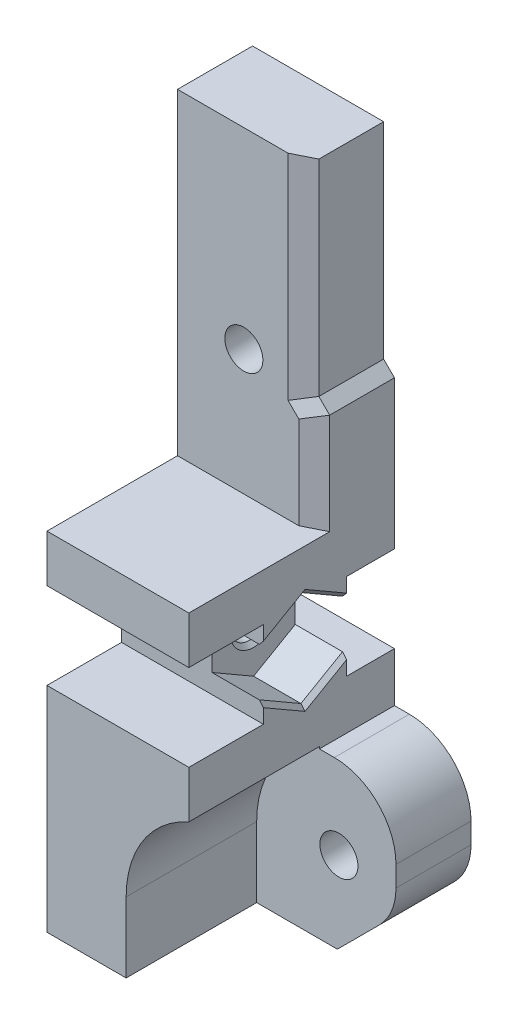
from build123d import *

# Parameters (mm, degrees)
SKETCH1_W           = 13.8
SKETCH1_H           = 17.6
BOSS_EXTRUDE1_DEPTH = 20
BOSS_EXTRUDE2_DEPTH = 7.3
BOSS_EXTRUDE3_DEPTH = 7.3
BOSS_EXTRUDE4_DEPTH = 12.7
CUT_EXTRUDE1_DEPTH  = 55.42350444
SKETCH7_R           = 1.85
CUT_EXTRUDE2_DEPTH  = 55.42350444
SKETCH8_R           = 1.85
CUT_EXTRUDE3_DEPTH  = 55.42350444
CUT_EXTRUDE4_DEPTH  = 4
SKETCH10_W          = 4.65
SKETCH10_H          = 8.4
CUT_EXTRUDE5_DEPTH  = 57.574091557
CUT_EXTRUDE7_DEPTH  = 5
SKETCH15_R          = 1.85
CUT_EXTRUDE10_DEPTH = 8.8
SKETCH13_W          = 7.25
SKETCH13_H          = 8.4
CUT_EXTRUDE8_DEPTH  = 57.574091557
CUT_EXTRUDE9_DEPTH  = 57.574091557
CHAMFER1_SIZE       = 2
CHAMFER1_SIZE2      = 1
CHAMFER2_SIZE       = 0.4
CHAMFER3_SIZE       = 0.4
FILLET1_R           = 6


with BuildPart() as part:
    # Sketch1 → Boss-Extrude1 (new body)
    with BuildSketch(Plane.XY):
        with Locations((6.9, 8.8)):
            Rectangle(SKETCH1_W, SKETCH1_H)
    extrude(amount=BOSS_EXTRUDE1_DEPTH)

    # Sketch2 → Boss-Extrude2 (add)
    with BuildSketch(Plane(origin=(0, 0, 0), x_dir=(-1, 0, 0), z_dir=(0, 0, -1))):
        Polygon((-21.25, -0.2), (-21.25, -16.2), (0, -16.2), (0, 0), (-13.8, 0), (-13.8, -0.2), align=None)
    extrude(amount=-BOSS_EXTRUDE2_DEPTH)

    # Sketch3 → Boss-Extrude3 (add)
    with BuildSketch(Plane(origin=(0, 0, 0), x_dir=(-1, 0, 0), z_dir=(0, 0, -1))):
        Polygon((-13.8, 17.6), (-21.25, 17.6), (-21.25, 24.1), (-17.117157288, 24.1), (-12.75, 28.467157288), (-12.75, 48.467157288), (0, 48.467157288), (0, 17.6), align=None)
    extrude(amount=-BOSS_EXTRUDE3_DEPTH)

    # Sketch4 → Boss-Extrude4 (add)
    with BuildSketch(Plane.XY.offset(7.3)):
        with BuildLine():
            Line((7.7, -16.2), (7.7, -9.372368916))
            ThreePointArc((7.7, -9.372368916), (9.359305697, -3.781052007), (13.8, 0))
            Line((13.8, 0), (0, 0))
            Line((0, 0), (0, -16.2))
            Line((0, -16.2), (7.7, -16.2))
        make_face()
    extrude(amount=BOSS_EXTRUDE4_DEPTH)

    # Sketch6 → Cut-Extrude1 (cut, through all)
    with BuildSketch(Plane.XY.offset(7.3)):
        Polygon((13.8, 17.6), (13.8, 27.417157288), (17.117157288, 24.1), (21.25, 24.1), (21.25, 17.6), align=None)
    extrude(amount=-CUT_EXTRUDE1_DEPTH, mode=Mode.SUBTRACT)

    # Sketch7 → Cut-Extrude2 (cut, through all)
    with BuildSketch(Plane.XY.offset(7.3)):
        with Locations((15.7, -8.2)):
            Circle(SKETCH7_R)
    extrude(amount=-CUT_EXTRUDE2_DEPTH, mode=Mode.SUBTRACT)

    # Sketch8 → Cut-Extrude3 (cut, through all)
    with BuildSketch(Plane.XY.offset(7.3)):
        with Locations((6.45, 29.8)):
            Circle(SKETCH8_R)
    extrude(amount=-CUT_EXTRUDE3_DEPTH, mode=Mode.SUBTRACT)

    # Sketch9 → Cut-Extrude4 (cut)
    with BuildSketch(Plane(origin=(0, 0, 0), x_dir=(-1, 0, 0), z_dir=(0, 0, -1))):
        Polygon((-10.5, 32.13826859), (-10.5, 27.46173141), (-6.45, 25.12346282), (-2.4, 27.46173141), (-2.4, 32.13826859), (-6.45, 34.47653718), align=None)
        Polygon((-15.7, -12.87653718), (-11.65, -10.53826859), (-11.65, -5.86173141), (-15.7, -3.52346282), (-19.75, -5.86173141), (-19.75, -10.53826859), align=None)
    extrude(amount=-CUT_EXTRUDE4_DEPTH, mode=Mode.SUBTRACT)

    # Sketch10 → Cut-Extrude5 (cut, through all)
    with BuildSketch(Plane.ZY):
        with Locations((2.325, 8.8)):
            Rectangle(SKETCH10_W, SKETCH10_H)
    extrude(amount=-CUT_EXTRUDE5_DEPTH, mode=Mode.SUBTRACT)

    # Sketch12 → Cut-Extrude7 (cut)
    with BuildSketch(Plane(origin=(13.8, 0, 0), x_dir=(0, 0, -1), z_dir=(1, 0, 0))):
        Polygon((-8.7, 4.12346282), (-4.65, 6.46173141), (-4.65, 11.13826859), (-8.7, 13.47653718), (-12.75, 11.13826859), (-12.75, 6.46173141), align=None)
    extrude(amount=-CUT_EXTRUDE7_DEPTH, mode=Mode.SUBTRACT)

    # Sketch15 → Cut-Extrude10 (cut)
    with BuildSketch(Plane(origin=(8.8, 0, 0), x_dir=(0, 0, -1), z_dir=(1, 0, 0))):
        with Locations((-8.7, 8.8)):
            Circle(SKETCH15_R)
    extrude(amount=-CUT_EXTRUDE10_DEPTH, mode=Mode.SUBTRACT)

    # Sketch13 → Cut-Extrude8 (cut, through all)
    with BuildSketch(Plane.ZY):
        with Locations((16.375, 8.8)):
            Rectangle(SKETCH13_W, SKETCH13_H)
    extrude(amount=-CUT_EXTRUDE8_DEPTH, mode=Mode.SUBTRACT)

    # Sketch14 → Cut-Extrude9 (cut, through all)
    with BuildSketch(Plane(origin=(0, 0, 0), x_dir=(-1, 0, 0), z_dir=(0, 0, -1))):
        with BuildLine():
            Line((-19.624442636, -12.124442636), (-15.548885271, -16.2))
            Line((-15.548885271, -16.2), (-21.25, -16.2))
            Line((-21.25, -16.2), (-21.25, -8.2))
            ThreePointArc((-21.25, -8.2), (-20.827531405, -10.32389305), (-19.624442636, -12.124442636))
        make_face()
    extrude(amount=-CUT_EXTRUDE9_DEPTH, mode=Mode.SUBTRACT)

    # Chamfer1
    chamfer1_edges = [part.edges().sort_by_distance(p)[0] for p in [
        (12.75, 38.467157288, 7.3),
        (13.8, 22.508578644, 7.3),
        (13.275, 27.942157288, 7.3),
    ]]
    chamfer1_side = [part.faces().sort_by_distance(p)[0] for p in [
        (6.563044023, 32.838927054, 7.3),
    ]]
    chamfer(chamfer1_edges, length=CHAMFER1_SIZE, length2=CHAMFER1_SIZE2, reference=chamfer1_side[0])

    # Chamfer2
    chamfer2_edges = [part.edges().sort_by_distance(p)[0] for p in [
        (8.8, 8.8, 10.55),
    ]]
    chamfer(chamfer2_edges, length=CHAMFER2_SIZE)

    # Chamfer3
    chamfer3_edges = [part.edges().sort_by_distance(p)[0] for p in [
        (13.8, 5.292597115, 10.725),
        (13.8, 5.292597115, 6.675),
        (13.8, 12.307402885, 6.675),
        (13.8, 12.307402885, 10.725),
    ]]
    chamfer(chamfer3_edges, length=CHAMFER3_SIZE)

    # Fillet1
    fillet1_edges = [part.edges().sort_by_distance(p)[0] for p in [
        (21.25, -0.2, 3.65),
    ]]
    fillet(fillet1_edges, radius=FILLET1_R)


solid = part.part
